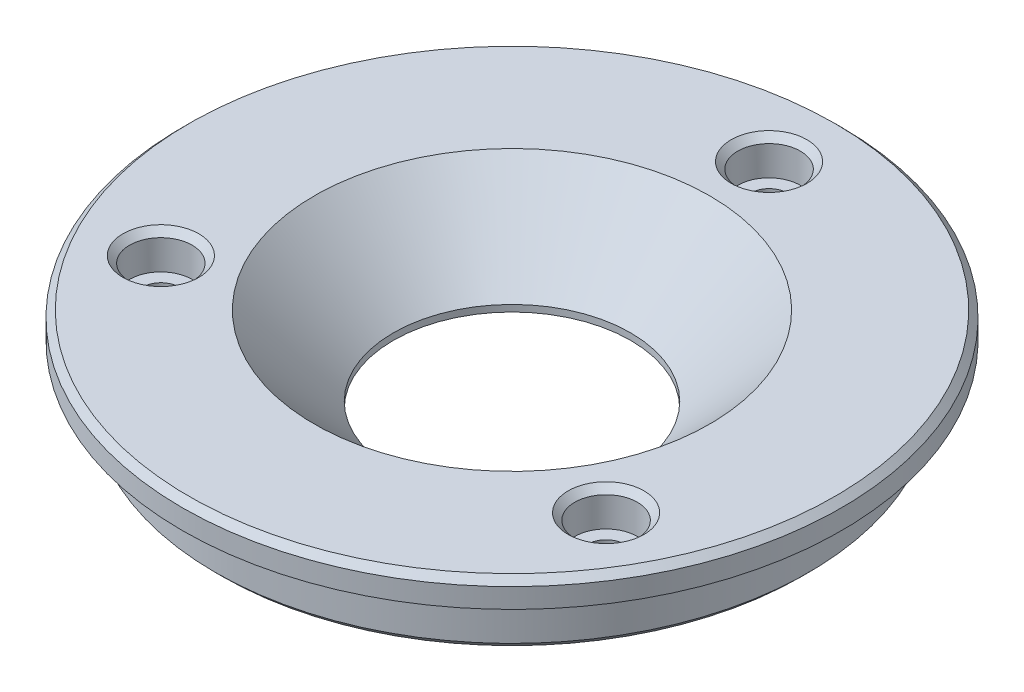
ISO-10303-21;
HEADER;
FILE_DESCRIPTION(('STEP AP214'),'2;1');
FILE_NAME('part.step','',(''),(''),'','','');
FILE_SCHEMA(('AUTOMOTIVE_DESIGN { 1 0 10303 214 1 1 1 1 }'));
ENDSEC;
DATA;
#1=APPLICATION_CONTEXT('core data for automotive mechanical design processes');
#2=APPLICATION_PROTOCOL_DEFINITION('international standard','automotive_design',2000,#1);
#3=PRODUCT_CONTEXT('',#1,'mechanical');
#4=PRODUCT('Part','Part','',(#3));
#5=PRODUCT_RELATED_PRODUCT_CATEGORY('part','',(#4));
#6=PRODUCT_DEFINITION_FORMATION('','',#4);
#7=PRODUCT_DEFINITION_CONTEXT('part definition',#1,'design');
#8=PRODUCT_DEFINITION('design','',#6,#7);
#9=PRODUCT_DEFINITION_SHAPE('','',#8);
#10=(LENGTH_UNIT() NAMED_UNIT(*) SI_UNIT(.MILLI.,.METRE.));
#11=(NAMED_UNIT(*) PLANE_ANGLE_UNIT() SI_UNIT($,.RADIAN.));
#12=(NAMED_UNIT(*) SI_UNIT($,.STERADIAN.) SOLID_ANGLE_UNIT());
#13=UNCERTAINTY_MEASURE_WITH_UNIT(LENGTH_MEASURE(1.E-05),#10,'distance_accuracy_value','');
#14=(GEOMETRIC_REPRESENTATION_CONTEXT(3) GLOBAL_UNCERTAINTY_ASSIGNED_CONTEXT((#13)) GLOBAL_UNIT_ASSIGNED_CONTEXT((#10,
#11,#12)) REPRESENTATION_CONTEXT('',''));
#15=CARTESIAN_POINT('',(0.,0.,0.));
#16=DIRECTION('',(0.,0.,1.));
#17=DIRECTION('',(1.,0.,0.));
#18=AXIS2_PLACEMENT_3D('',#15,#16,#17);
#19=CARTESIAN_POINT('',(-30.,13.,0.));
#20=DIRECTION('',(0.,-1.,0.));
#21=DIRECTION('',(0.,0.,-1.));
#22=AXIS2_PLACEMENT_3D('',#19,#20,#21);
#23=PLANE('',#22);
#24=CARTESIAN_POINT('',(33.7749907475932,13.,19.5));
#25=DIRECTION('',(0.,-1.,0.));
#26=DIRECTION('',(0.,0.,-1.));
#27=AXIS2_PLACEMENT_3D('',#24,#25,#26);
#28=CIRCLE('',#27,5.75);
#29=CARTESIAN_POINT('',(33.7749907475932,13.,13.75));
#30=VERTEX_POINT('',#29);
#31=EDGE_CURVE('E25',#30,#30,#28,.T.);
#32=ORIENTED_EDGE('',*,*,#31,.T.);
#33=EDGE_LOOP('',(#32));
#34=FACE_BOUND('',#33,.T.);
#35=CARTESIAN_POINT('',(0.,13.,-39.));
#36=DIRECTION('',(0.,-1.,0.));
#37=DIRECTION('',(0.,0.,-1.));
#38=AXIS2_PLACEMENT_3D('',#35,#36,#37);
#39=CIRCLE('',#38,5.75);
#40=CARTESIAN_POINT('',(0.,13.,-44.75));
#41=VERTEX_POINT('',#40);
#42=EDGE_CURVE('E29',#41,#41,#39,.T.);
#43=ORIENTED_EDGE('',*,*,#42,.T.);
#44=EDGE_LOOP('',(#43));
#45=FACE_BOUND('',#44,.T.);
#46=CARTESIAN_POINT('',(-33.7749907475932,13.,19.5));
#47=DIRECTION('',(0.,-1.,0.));
#48=DIRECTION('',(0.,0.,-1.));
#49=AXIS2_PLACEMENT_3D('',#46,#47,#48);
#50=CIRCLE('',#49,5.75);
#51=CARTESIAN_POINT('',(-33.7749907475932,13.,13.75));
#52=VERTEX_POINT('',#51);
#53=EDGE_CURVE('E34',#52,#52,#50,.T.);
#54=ORIENTED_EDGE('',*,*,#53,.T.);
#55=EDGE_LOOP('',(#54));
#56=FACE_BOUND('',#55,.T.);
#57=CARTESIAN_POINT('',(0.,13.,0.));
#58=DIRECTION('',(0.,-1.,0.));
#59=DIRECTION('',(0.,0.,-1.));
#60=AXIS2_PLACEMENT_3D('',#57,#58,#59);
#61=CIRCLE('',#60,49.);
#62=CARTESIAN_POINT('',(0.,13.,-49.));
#63=VERTEX_POINT('',#62);
#64=EDGE_CURVE('E58',#63,#63,#61,.F.);
#65=ORIENTED_EDGE('',*,*,#64,.T.);
#66=EDGE_LOOP('',(#65));
#67=FACE_BOUND('',#66,.T.);
#68=CARTESIAN_POINT('',(0.,13.,0.));
#69=DIRECTION('',(0.,-1.,0.));
#70=DIRECTION('',(0.,0.,-1.));
#71=AXIS2_PLACEMENT_3D('',#68,#69,#70);
#72=CIRCLE('',#71,30.);
#73=CARTESIAN_POINT('',(0.,13.,-30.));
#74=VERTEX_POINT('',#73);
#75=EDGE_CURVE('E70',#74,#74,#72,.T.);
#76=ORIENTED_EDGE('',*,*,#75,.T.);
#77=EDGE_LOOP('',(#76));
#78=FACE_BOUND('',#77,.T.);
#79=ADVANCED_FACE('F14',(#34,#45,#56,#67,#78),#23,.F.);
#80=CARTESIAN_POINT('',(0.,1.,0.));
#81=DIRECTION('',(0.,1.,0.));
#82=DIRECTION('',(0.,0.,1.));
#83=AXIS2_PLACEMENT_3D('',#80,#81,#82);
#84=CONICAL_SURFACE('',#83,18.,0.78539816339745);
#85=ORIENTED_EDGE('',*,*,#75,.F.);
#86=EDGE_LOOP('',(#85));
#87=FACE_BOUND('',#86,.T.);
#88=CARTESIAN_POINT('',(0.,1.,0.));
#89=DIRECTION('',(0.,-1.,0.));
#90=DIRECTION('',(0.,0.,-1.));
#91=AXIS2_PLACEMENT_3D('',#88,#89,#90);
#92=CIRCLE('',#91,18.);
#93=CARTESIAN_POINT('',(0.,1.,-18.));
#94=VERTEX_POINT('',#93);
#95=EDGE_CURVE('E83',#94,#94,#92,.T.);
#96=ORIENTED_EDGE('',*,*,#95,.T.);
#97=EDGE_LOOP('',(#96));
#98=FACE_BOUND('',#97,.T.);
#99=ADVANCED_FACE('F123',(#87,#98),#84,.F.);
#100=CARTESIAN_POINT('',(0.,0.,0.));
#101=DIRECTION('',(0.,-1.,0.));
#102=DIRECTION('',(0.,0.,-1.));
#103=AXIS2_PLACEMENT_3D('',#100,#101,#102);
#104=CYLINDRICAL_SURFACE('',#103,18.);
#105=ORIENTED_EDGE('',*,*,#95,.F.);
#106=EDGE_LOOP('',(#105));
#107=FACE_BOUND('',#106,.T.);
#108=CARTESIAN_POINT('',(0.,0.,0.));
#109=DIRECTION('',(0.,-1.,0.));
#110=DIRECTION('',(0.,0.,-1.));
#111=AXIS2_PLACEMENT_3D('',#108,#109,#110);
#112=CIRCLE('',#111,18.);
#113=CARTESIAN_POINT('',(0.,0.,-18.));
#114=VERTEX_POINT('',#113);
#115=EDGE_CURVE('E86',#114,#114,#112,.T.);
#116=ORIENTED_EDGE('',*,*,#115,.T.);
#117=EDGE_LOOP('',(#116));
#118=FACE_BOUND('',#117,.T.);
#119=ADVANCED_FACE('F130',(#107,#118),#104,.F.);
#120=CARTESIAN_POINT('',(-18.,0.,0.));
#121=DIRECTION('',(0.,1.,0.));
#122=DIRECTION('',(0.,0.,1.));
#123=AXIS2_PLACEMENT_3D('',#120,#121,#122);
#124=PLANE('',#123);
#125=CARTESIAN_POINT('',(-33.7749907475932,0.,19.5));
#126=DIRECTION('',(0.,1.,0.));
#127=DIRECTION('',(0.,0.,1.));
#128=AXIS2_PLACEMENT_3D('',#125,#126,#127);
#129=CIRCLE('',#128,3.75);
#130=CARTESIAN_POINT('',(-33.7749907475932,0.,23.25));
#131=VERTEX_POINT('',#130);
#132=EDGE_CURVE('E49',#131,#131,#129,.T.);
#133=ORIENTED_EDGE('',*,*,#132,.T.);
#134=EDGE_LOOP('',(#133));
#135=FACE_BOUND('',#134,.T.);
#136=CARTESIAN_POINT('',(33.7749907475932,0.,19.5));
#137=DIRECTION('',(0.,1.,0.));
#138=DIRECTION('',(0.,0.,1.));
#139=AXIS2_PLACEMENT_3D('',#136,#137,#138);
#140=CIRCLE('',#139,3.75);
#141=CARTESIAN_POINT('',(33.7749907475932,0.,23.25));
#142=VERTEX_POINT('',#141);
#143=EDGE_CURVE('E52',#142,#142,#140,.T.);
#144=ORIENTED_EDGE('',*,*,#143,.T.);
#145=EDGE_LOOP('',(#144));
#146=FACE_BOUND('',#145,.T.);
#147=CARTESIAN_POINT('',(0.,0.,-39.));
#148=DIRECTION('',(0.,1.,0.));
#149=DIRECTION('',(0.,0.,1.));
#150=AXIS2_PLACEMENT_3D('',#147,#148,#149);
#151=CIRCLE('',#150,3.75);
#152=CARTESIAN_POINT('',(0.,0.,-35.25));
#153=VERTEX_POINT('',#152);
#154=EDGE_CURVE('E55',#153,#153,#151,.T.);
#155=ORIENTED_EDGE('',*,*,#154,.T.);
#156=EDGE_LOOP('',(#155));
#157=FACE_BOUND('',#156,.T.);
#158=CARTESIAN_POINT('',(0.,0.,0.));
#159=DIRECTION('',(0.,1.,0.));
#160=DIRECTION('',(0.,0.,1.));
#161=AXIS2_PLACEMENT_3D('',#158,#159,#160);
#162=CIRCLE('',#161,44.);
#163=CARTESIAN_POINT('',(0.,0.,44.));
#164=VERTEX_POINT('',#163);
#165=EDGE_CURVE('E67',#164,#164,#162,.F.);
#166=ORIENTED_EDGE('',*,*,#165,.T.);
#167=EDGE_LOOP('',(#166));
#168=FACE_BOUND('',#167,.T.);
#169=ORIENTED_EDGE('',*,*,#115,.F.);
#170=EDGE_LOOP('',(#169));
#171=FACE_BOUND('',#170,.T.);
#172=ADVANCED_FACE('F181',(#135,#146,#157,#168,#171),#124,.F.);
#173=CARTESIAN_POINT('',(0.,0.,0.));
#174=DIRECTION('',(0.,-1.,0.));
#175=DIRECTION('',(0.,0.,-1.));
#176=AXIS2_PLACEMENT_3D('',#173,#174,#175);
#177=CYLINDRICAL_SURFACE('',#176,45.);
#178=CARTESIAN_POINT('',(0.,1.00000000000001,0.));
#179=DIRECTION('',(0.,1.,0.));
#180=DIRECTION('',(0.,0.,1.));
#181=AXIS2_PLACEMENT_3D('',#178,#179,#180);
#182=CIRCLE('',#181,45.);
#183=CARTESIAN_POINT('',(0.,1.00000000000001,45.));
#184=VERTEX_POINT('',#183);
#185=EDGE_CURVE('E64',#184,#184,#182,.T.);
#186=ORIENTED_EDGE('',*,*,#185,.T.);
#187=EDGE_LOOP('',(#186));
#188=FACE_BOUND('',#187,.T.);
#189=CARTESIAN_POINT('',(0.,9.,0.));
#190=DIRECTION('',(0.,-1.,0.));
#191=DIRECTION('',(0.,0.,-1.));
#192=AXIS2_PLACEMENT_3D('',#189,#190,#191);
#193=CIRCLE('',#192,45.);
#194=CARTESIAN_POINT('',(0.,9.,-45.));
#195=VERTEX_POINT('',#194);
#196=EDGE_CURVE('E89',#195,#195,#193,.T.);
#197=ORIENTED_EDGE('',*,*,#196,.T.);
#198=EDGE_LOOP('',(#197));
#199=FACE_BOUND('',#198,.T.);
#200=ADVANCED_FACE('F185',(#188,#199),#177,.T.);
#201=CARTESIAN_POINT('',(-45.,9.,0.));
#202=DIRECTION('',(0.,1.,0.));
#203=DIRECTION('',(0.,0.,1.));
#204=AXIS2_PLACEMENT_3D('',#201,#202,#203);
#205=PLANE('',#204);
#206=ORIENTED_EDGE('',*,*,#196,.F.);
#207=EDGE_LOOP('',(#206));
#208=FACE_BOUND('',#207,.T.);
#209=CARTESIAN_POINT('',(0.,9.,0.));
#210=DIRECTION('',(0.,-1.,0.));
#211=DIRECTION('',(0.,0.,-1.));
#212=AXIS2_PLACEMENT_3D('',#209,#210,#211);
#213=CIRCLE('',#212,50.);
#214=CARTESIAN_POINT('',(0.,9.,-50.));
#215=VERTEX_POINT('',#214);
#216=EDGE_CURVE('E92',#215,#215,#213,.T.);
#217=ORIENTED_EDGE('',*,*,#216,.T.);
#218=EDGE_LOOP('',(#217));
#219=FACE_BOUND('',#218,.T.);
#220=ADVANCED_FACE('F192',(#208,#219),#205,.F.);
#221=CARTESIAN_POINT('',(0.,0.,0.));
#222=DIRECTION('',(0.,-1.,0.));
#223=DIRECTION('',(0.,0.,-1.));
#224=AXIS2_PLACEMENT_3D('',#221,#222,#223);
#225=CYLINDRICAL_SURFACE('',#224,50.);
#226=CARTESIAN_POINT('',(0.,12.,0.));
#227=DIRECTION('',(0.,-1.,0.));
#228=DIRECTION('',(0.,0.,-1.));
#229=AXIS2_PLACEMENT_3D('',#226,#227,#228);
#230=CIRCLE('',#229,50.);
#231=CARTESIAN_POINT('',(0.,12.,-50.));
#232=VERTEX_POINT('',#231);
#233=EDGE_CURVE('E61',#232,#232,#230,.T.);
#234=ORIENTED_EDGE('',*,*,#233,.T.);
#235=EDGE_LOOP('',(#234));
#236=FACE_BOUND('',#235,.T.);
#237=ORIENTED_EDGE('',*,*,#216,.F.);
#238=EDGE_LOOP('',(#237));
#239=FACE_BOUND('',#238,.T.);
#240=ADVANCED_FACE('F199',(#236,#239),#225,.T.);
#241=CARTESIAN_POINT('',(33.7749907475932,7.5,19.5));
#242=DIRECTION('',(0.,1.,0.));
#243=DIRECTION('',(0.,0.,1.));
#244=AXIS2_PLACEMENT_3D('',#241,#242,#243);
#245=CYLINDRICAL_SURFACE('',#244,4.75);
#246=CARTESIAN_POINT('',(33.7749907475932,12.,19.5));
#247=DIRECTION('',(0.,-1.,0.));
#248=DIRECTION('',(0.,0.,-1.));
#249=AXIS2_PLACEMENT_3D('',#246,#247,#248);
#250=CIRCLE('',#249,4.75);
#251=CARTESIAN_POINT('',(33.7749907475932,12.,14.75));
#252=VERTEX_POINT('',#251);
#253=EDGE_CURVE('E37',#252,#252,#250,.F.);
#254=ORIENTED_EDGE('',*,*,#253,.T.);
#255=EDGE_LOOP('',(#254));
#256=FACE_BOUND('',#255,.T.);
#257=CARTESIAN_POINT('',(33.7749907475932,7.5,19.5));
#258=DIRECTION('',(0.,1.,0.));
#259=DIRECTION('',(0.,0.,-1.));
#260=AXIS2_PLACEMENT_3D('',#257,#258,#259);
#261=CIRCLE('',#260,4.75);
#262=CARTESIAN_POINT('',(33.7749907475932,7.5,14.75));
#263=VERTEX_POINT('',#262);
#264=EDGE_CURVE('E74',#263,#263,#261,.T.);
#265=ORIENTED_EDGE('',*,*,#264,.F.);
#266=EDGE_LOOP('',(#265));
#267=FACE_BOUND('',#266,.T.);
#268=ADVANCED_FACE('F203',(#256,#267),#245,.F.);
#269=CARTESIAN_POINT('',(33.7749907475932,7.5,19.5));
#270=DIRECTION('',(0.,-1.,0.));
#271=DIRECTION('',(0.,0.,-1.));
#272=AXIS2_PLACEMENT_3D('',#269,#270,#271);
#273=PLANE('',#272);
#274=CARTESIAN_POINT('',(33.7749907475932,7.5,19.5));
#275=DIRECTION('',(0.,-1.,0.));
#276=DIRECTION('',(0.,0.,-1.));
#277=AXIS2_PLACEMENT_3D('',#274,#275,#276);
#278=CIRCLE('',#277,2.75);
#279=CARTESIAN_POINT('',(33.7749907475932,7.5,16.75));
#280=VERTEX_POINT('',#279);
#281=EDGE_CURVE('E71',#280,#280,#278,.T.);
#282=ORIENTED_EDGE('',*,*,#281,.T.);
#283=EDGE_LOOP('',(#282));
#284=FACE_BOUND('',#283,.T.);
#285=ORIENTED_EDGE('',*,*,#264,.T.);
#286=EDGE_LOOP('',(#285));
#287=FACE_BOUND('',#286,.T.);
#288=ADVANCED_FACE('F207',(#284,#287),#273,.F.);
#289=CARTESIAN_POINT('',(-33.7749907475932,7.5,19.5));
#290=DIRECTION('',(0.,1.,0.));
#291=DIRECTION('',(0.,0.,1.));
#292=AXIS2_PLACEMENT_3D('',#289,#290,#291);
#293=CYLINDRICAL_SURFACE('',#292,4.75);
#294=CARTESIAN_POINT('',(-33.7749907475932,12.,19.5));
#295=DIRECTION('',(0.,-1.,0.));
#296=DIRECTION('',(0.,0.,-1.));
#297=AXIS2_PLACEMENT_3D('',#294,#295,#296);
#298=CIRCLE('',#297,4.75);
#299=CARTESIAN_POINT('',(-33.7749907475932,12.,14.75));
#300=VERTEX_POINT('',#299);
#301=EDGE_CURVE('E9',#300,#300,#298,.F.);
#302=ORIENTED_EDGE('',*,*,#301,.T.);
#303=EDGE_LOOP('',(#302));
#304=FACE_BOUND('',#303,.T.);
#305=CARTESIAN_POINT('',(-33.7749907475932,7.5,19.5));
#306=DIRECTION('',(0.,1.,0.));
#307=DIRECTION('',(0.,0.,1.));
#308=AXIS2_PLACEMENT_3D('',#305,#306,#307);
#309=CIRCLE('',#308,4.75);
#310=CARTESIAN_POINT('',(-33.7749907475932,7.5,24.25));
#311=VERTEX_POINT('',#310);
#312=EDGE_CURVE('E98',#311,#311,#309,.T.);
#313=ORIENTED_EDGE('',*,*,#312,.F.);
#314=EDGE_LOOP('',(#313));
#315=FACE_BOUND('',#314,.T.);
#316=ADVANCED_FACE('F119',(#304,#315),#293,.F.);
#317=CARTESIAN_POINT('',(-33.7749907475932,7.5,19.5));
#318=DIRECTION('',(0.,1.,0.));
#319=DIRECTION('',(0.,0.,1.));
#320=AXIS2_PLACEMENT_3D('',#317,#318,#319);
#321=PLANE('',#320);
#322=CARTESIAN_POINT('',(-33.7749907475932,7.5,19.5));
#323=DIRECTION('',(0.,1.,0.));
#324=DIRECTION('',(0.,0.,1.));
#325=AXIS2_PLACEMENT_3D('',#322,#323,#324);
#326=CIRCLE('',#325,2.75);
#327=CARTESIAN_POINT('',(-33.7749907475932,7.5,22.25));
#328=VERTEX_POINT('',#327);
#329=EDGE_CURVE('E75',#328,#328,#326,.T.);
#330=ORIENTED_EDGE('',*,*,#329,.F.);
#331=EDGE_LOOP('',(#330));
#332=FACE_BOUND('',#331,.T.);
#333=ORIENTED_EDGE('',*,*,#312,.T.);
#334=EDGE_LOOP('',(#333));
#335=FACE_BOUND('',#334,.T.);
#336=ADVANCED_FACE('F108',(#332,#335),#321,.T.);
#337=CARTESIAN_POINT('',(0.,7.5,-39.));
#338=DIRECTION('',(0.,1.,0.));
#339=DIRECTION('',(0.,0.,1.));
#340=AXIS2_PLACEMENT_3D('',#337,#338,#339);
#341=CYLINDRICAL_SURFACE('',#340,4.75);
#342=CARTESIAN_POINT('',(0.,12.,-39.));
#343=DIRECTION('',(0.,-1.,0.));
#344=DIRECTION('',(0.,0.,-1.));
#345=AXIS2_PLACEMENT_3D('',#342,#343,#344);
#346=CIRCLE('',#345,4.75);
#347=CARTESIAN_POINT('',(0.,12.,-43.75));
#348=VERTEX_POINT('',#347);
#349=EDGE_CURVE('E21',#348,#348,#346,.F.);
#350=ORIENTED_EDGE('',*,*,#349,.T.);
#351=EDGE_LOOP('',(#350));
#352=FACE_BOUND('',#351,.T.);
#353=CARTESIAN_POINT('',(0.,7.5,-39.));
#354=DIRECTION('',(0.,1.,0.));
#355=DIRECTION('',(0.,0.,1.));
#356=AXIS2_PLACEMENT_3D('',#353,#354,#355);
#357=CIRCLE('',#356,4.75);
#358=CARTESIAN_POINT('',(0.,7.5,-34.25));
#359=VERTEX_POINT('',#358);
#360=EDGE_CURVE('E95',#359,#359,#357,.T.);
#361=ORIENTED_EDGE('',*,*,#360,.F.);
#362=EDGE_LOOP('',(#361));
#363=FACE_BOUND('',#362,.T.);
#364=ADVANCED_FACE('F106',(#352,#363),#341,.F.);
#365=CARTESIAN_POINT('',(0.,7.5,-39.));
#366=DIRECTION('',(0.,1.,0.));
#367=DIRECTION('',(0.,0.,1.));
#368=AXIS2_PLACEMENT_3D('',#365,#366,#367);
#369=PLANE('',#368);
#370=CARTESIAN_POINT('',(0.,7.5,-39.));
#371=DIRECTION('',(0.,1.,0.));
#372=DIRECTION('',(0.,0.,1.));
#373=AXIS2_PLACEMENT_3D('',#370,#371,#372);
#374=CIRCLE('',#373,2.75);
#375=CARTESIAN_POINT('',(0.,7.5,-36.25));
#376=VERTEX_POINT('',#375);
#377=EDGE_CURVE('E78',#376,#376,#374,.T.);
#378=ORIENTED_EDGE('',*,*,#377,.F.);
#379=EDGE_LOOP('',(#378));
#380=FACE_BOUND('',#379,.T.);
#381=ORIENTED_EDGE('',*,*,#360,.T.);
#382=EDGE_LOOP('',(#381));
#383=FACE_BOUND('',#382,.T.);
#384=ADVANCED_FACE('F104',(#380,#383),#369,.T.);
#385=CARTESIAN_POINT('',(0.,0.,-39.));
#386=DIRECTION('',(0.,1.,0.));
#387=DIRECTION('',(0.,0.,1.));
#388=AXIS2_PLACEMENT_3D('',#385,#386,#387);
#389=CYLINDRICAL_SURFACE('',#388,2.75);
#390=CARTESIAN_POINT('',(0.,1.00000000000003,-39.));
#391=DIRECTION('',(0.,1.,0.));
#392=DIRECTION('',(0.,0.,1.));
#393=AXIS2_PLACEMENT_3D('',#390,#391,#392);
#394=CIRCLE('',#393,2.75);
#395=CARTESIAN_POINT('',(0.,1.00000000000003,-36.25));
#396=VERTEX_POINT('',#395);
#397=EDGE_CURVE('E40',#396,#396,#394,.F.);
#398=ORIENTED_EDGE('',*,*,#397,.T.);
#399=EDGE_LOOP('',(#398));
#400=FACE_BOUND('',#399,.T.);
#401=ORIENTED_EDGE('',*,*,#377,.T.);
#402=EDGE_LOOP('',(#401));
#403=FACE_BOUND('',#402,.T.);
#404=ADVANCED_FACE('F116',(#400,#403),#389,.F.);
#405=CARTESIAN_POINT('',(-33.7749907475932,0.,19.5));
#406=DIRECTION('',(0.,1.,0.));
#407=DIRECTION('',(0.,0.,1.));
#408=AXIS2_PLACEMENT_3D('',#405,#406,#407);
#409=CYLINDRICAL_SURFACE('',#408,2.75);
#410=CARTESIAN_POINT('',(-33.7749907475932,1.,19.5));
#411=DIRECTION('',(0.,1.,0.));
#412=DIRECTION('',(0.,0.,1.));
#413=AXIS2_PLACEMENT_3D('',#410,#411,#412);
#414=CIRCLE('',#413,2.75);
#415=CARTESIAN_POINT('',(-33.7749907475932,1.,22.25));
#416=VERTEX_POINT('',#415);
#417=EDGE_CURVE('E46',#416,#416,#414,.F.);
#418=ORIENTED_EDGE('',*,*,#417,.T.);
#419=EDGE_LOOP('',(#418));
#420=FACE_BOUND('',#419,.T.);
#421=ORIENTED_EDGE('',*,*,#329,.T.);
#422=EDGE_LOOP('',(#421));
#423=FACE_BOUND('',#422,.T.);
#424=ADVANCED_FACE('F338',(#420,#423),#409,.F.);
#425=CARTESIAN_POINT('',(33.7749907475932,0.,19.5));
#426=DIRECTION('',(0.,1.,0.));
#427=DIRECTION('',(0.,0.,1.));
#428=AXIS2_PLACEMENT_3D('',#425,#426,#427);
#429=CYLINDRICAL_SURFACE('',#428,2.75);
#430=CARTESIAN_POINT('',(33.7749907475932,1.,19.5));
#431=DIRECTION('',(0.,1.,0.));
#432=DIRECTION('',(0.,0.,1.));
#433=AXIS2_PLACEMENT_3D('',#430,#431,#432);
#434=CIRCLE('',#433,2.75);
#435=CARTESIAN_POINT('',(33.7749907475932,1.,22.25));
#436=VERTEX_POINT('',#435);
#437=EDGE_CURVE('E43',#436,#436,#434,.F.);
#438=ORIENTED_EDGE('',*,*,#437,.T.);
#439=EDGE_LOOP('',(#438));
#440=FACE_BOUND('',#439,.T.);
#441=ORIENTED_EDGE('',*,*,#281,.F.);
#442=EDGE_LOOP('',(#441));
#443=FACE_BOUND('',#442,.T.);
#444=ADVANCED_FACE('F140',(#440,#443),#429,.F.);
#445=CARTESIAN_POINT('',(0.,0.,0.));
#446=DIRECTION('',(0.,1.,0.));
#447=DIRECTION('',(0.,0.,1.));
#448=AXIS2_PLACEMENT_3D('',#445,#446,#447);
#449=CONICAL_SURFACE('',#448,44.,0.785398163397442);
#450=ORIENTED_EDGE('',*,*,#185,.F.);
#451=EDGE_LOOP('',(#450));
#452=FACE_BOUND('',#451,.T.);
#453=ORIENTED_EDGE('',*,*,#165,.F.);
#454=EDGE_LOOP('',(#453));
#455=FACE_BOUND('',#454,.T.);
#456=ADVANCED_FACE('F136',(#452,#455),#449,.T.);
#457=CARTESIAN_POINT('',(0.,12.,0.));
#458=DIRECTION('',(0.,-1.,0.));
#459=DIRECTION('',(0.,0.,-1.));
#460=AXIS2_PLACEMENT_3D('',#457,#458,#459);
#461=CONICAL_SURFACE('',#460,50.,0.785398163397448);
#462=ORIENTED_EDGE('',*,*,#64,.F.);
#463=EDGE_LOOP('',(#462));
#464=FACE_BOUND('',#463,.T.);
#465=ORIENTED_EDGE('',*,*,#233,.F.);
#466=EDGE_LOOP('',(#465));
#467=FACE_BOUND('',#466,.T.);
#468=ADVANCED_FACE('F139',(#464,#467),#461,.T.);
#469=CARTESIAN_POINT('',(-33.7749907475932,0.,19.5));
#470=DIRECTION('',(0.,-1.,0.));
#471=DIRECTION('',(0.,0.,-1.));
#472=AXIS2_PLACEMENT_3D('',#469,#470,#471);
#473=CONICAL_SURFACE('',#472,3.75,0.785398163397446);
#474=ORIENTED_EDGE('',*,*,#417,.F.);
#475=EDGE_LOOP('',(#474));
#476=FACE_BOUND('',#475,.T.);
#477=ORIENTED_EDGE('',*,*,#132,.F.);
#478=EDGE_LOOP('',(#477));
#479=FACE_BOUND('',#478,.T.);
#480=ADVANCED_FACE('F144',(#476,#479),#473,.F.);
#481=CARTESIAN_POINT('',(33.7749907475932,0.,19.5));
#482=DIRECTION('',(0.,-1.,0.));
#483=DIRECTION('',(0.,0.,-1.));
#484=AXIS2_PLACEMENT_3D('',#481,#482,#483);
#485=CONICAL_SURFACE('',#484,3.75,0.785398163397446);
#486=ORIENTED_EDGE('',*,*,#437,.F.);
#487=EDGE_LOOP('',(#486));
#488=FACE_BOUND('',#487,.T.);
#489=ORIENTED_EDGE('',*,*,#143,.F.);
#490=EDGE_LOOP('',(#489));
#491=FACE_BOUND('',#490,.T.);
#492=ADVANCED_FACE('F148',(#488,#491),#485,.F.);
#493=CARTESIAN_POINT('',(0.,0.,-39.));
#494=DIRECTION('',(0.,-1.,0.));
#495=DIRECTION('',(0.,0.,-1.));
#496=AXIS2_PLACEMENT_3D('',#493,#494,#495);
#497=CONICAL_SURFACE('',#496,3.75,0.785398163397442);
#498=ORIENTED_EDGE('',*,*,#397,.F.);
#499=EDGE_LOOP('',(#498));
#500=FACE_BOUND('',#499,.T.);
#501=ORIENTED_EDGE('',*,*,#154,.F.);
#502=EDGE_LOOP('',(#501));
#503=FACE_BOUND('',#502,.T.);
#504=ADVANCED_FACE('F152',(#500,#503),#497,.F.);
#505=CARTESIAN_POINT('',(33.7749907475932,12.,19.5));
#506=DIRECTION('',(0.,1.,0.));
#507=DIRECTION('',(0.,0.,1.));
#508=AXIS2_PLACEMENT_3D('',#505,#506,#507);
#509=CONICAL_SURFACE('',#508,4.75,0.785398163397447);
#510=ORIENTED_EDGE('',*,*,#31,.F.);
#511=EDGE_LOOP('',(#510));
#512=FACE_BOUND('',#511,.T.);
#513=ORIENTED_EDGE('',*,*,#253,.F.);
#514=EDGE_LOOP('',(#513));
#515=FACE_BOUND('',#514,.T.);
#516=ADVANCED_FACE('F156',(#512,#515),#509,.F.);
#517=CARTESIAN_POINT('',(0.,12.,-39.));
#518=DIRECTION('',(0.,1.,0.));
#519=DIRECTION('',(0.,0.,1.));
#520=AXIS2_PLACEMENT_3D('',#517,#518,#519);
#521=CONICAL_SURFACE('',#520,4.75,0.785398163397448);
#522=ORIENTED_EDGE('',*,*,#42,.F.);
#523=EDGE_LOOP('',(#522));
#524=FACE_BOUND('',#523,.T.);
#525=ORIENTED_EDGE('',*,*,#349,.F.);
#526=EDGE_LOOP('',(#525));
#527=FACE_BOUND('',#526,.T.);
#528=ADVANCED_FACE('F159',(#524,#527),#521,.F.);
#529=CARTESIAN_POINT('',(-33.7749907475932,12.,19.5));
#530=DIRECTION('',(0.,1.,0.));
#531=DIRECTION('',(0.,0.,1.));
#532=AXIS2_PLACEMENT_3D('',#529,#530,#531);
#533=CONICAL_SURFACE('',#532,4.75,0.785398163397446);
#534=ORIENTED_EDGE('',*,*,#53,.F.);
#535=EDGE_LOOP('',(#534));
#536=FACE_BOUND('',#535,.T.);
#537=ORIENTED_EDGE('',*,*,#301,.F.);
#538=EDGE_LOOP('',(#537));
#539=FACE_BOUND('',#538,.T.);
#540=ADVANCED_FACE('F16',(#536,#539),#533,.F.);
#541=CLOSED_SHELL('',(#79,#99,#119,#172,#200,#220,#240,#268,#288,#316,#336,#364,#384,#404,#424,
#444,#456,#468,#480,#492,#504,#516,#528,#540));
#542=MANIFOLD_SOLID_BREP('B1',#541);
#543=ADVANCED_BREP_SHAPE_REPRESENTATION('',(#18,#542),#14);
#544=SHAPE_DEFINITION_REPRESENTATION(#9,#543);
ENDSEC;
END-ISO-10303-21;
